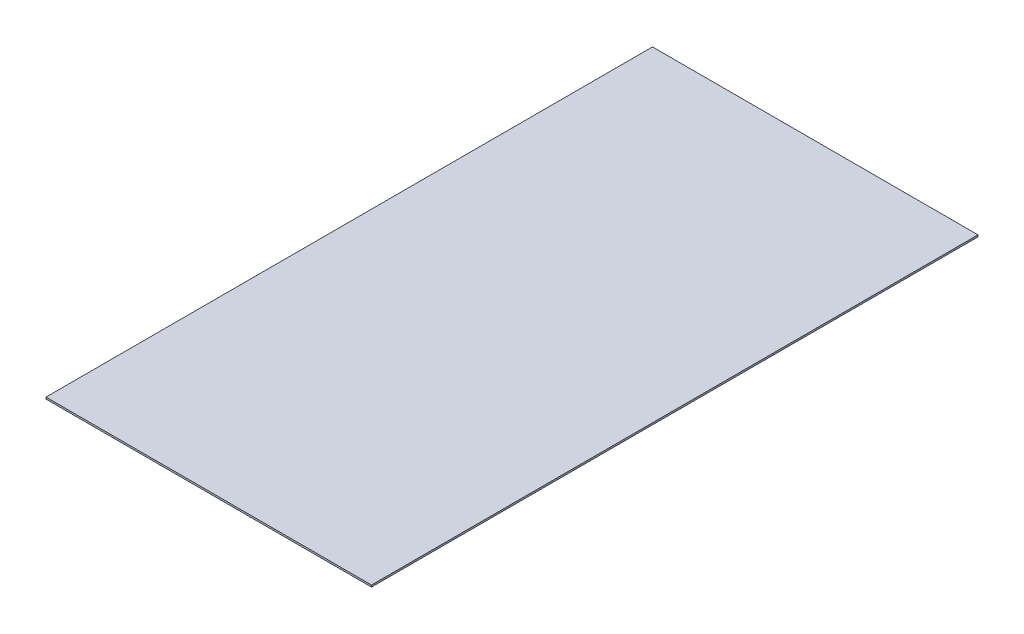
ISO-10303-21;
HEADER;
FILE_DESCRIPTION(('STEP AP214'),'2;1');
FILE_NAME('part.step','',(''),(''),'','','');
FILE_SCHEMA(('AUTOMOTIVE_DESIGN { 1 0 10303 214 1 1 1 1 }'));
ENDSEC;
DATA;
#1=APPLICATION_CONTEXT('core data for automotive mechanical design processes');
#2=APPLICATION_PROTOCOL_DEFINITION('international standard','automotive_design',2000,#1);
#3=PRODUCT_CONTEXT('',#1,'mechanical');
#4=PRODUCT('Part','Part','',(#3));
#5=PRODUCT_RELATED_PRODUCT_CATEGORY('part','',(#4));
#6=PRODUCT_DEFINITION_FORMATION('','',#4);
#7=PRODUCT_DEFINITION_CONTEXT('part definition',#1,'design');
#8=PRODUCT_DEFINITION('design','',#6,#7);
#9=PRODUCT_DEFINITION_SHAPE('','',#8);
#10=(LENGTH_UNIT() NAMED_UNIT(*) SI_UNIT(.MILLI.,.METRE.));
#11=(NAMED_UNIT(*) PLANE_ANGLE_UNIT() SI_UNIT($,.RADIAN.));
#12=(NAMED_UNIT(*) SI_UNIT($,.STERADIAN.) SOLID_ANGLE_UNIT());
#13=UNCERTAINTY_MEASURE_WITH_UNIT(LENGTH_MEASURE(1.E-05),#10,'distance_accuracy_value','');
#14=(GEOMETRIC_REPRESENTATION_CONTEXT(3) GLOBAL_UNCERTAINTY_ASSIGNED_CONTEXT((#13)) GLOBAL_UNIT_ASSIGNED_CONTEXT((#10,
#11,#12)) REPRESENTATION_CONTEXT('',''));
#15=CARTESIAN_POINT('',(0.,0.,0.));
#16=DIRECTION('',(0.,0.,1.));
#17=DIRECTION('',(1.,0.,0.));
#18=AXIS2_PLACEMENT_3D('',#15,#16,#17);
#19=CARTESIAN_POINT('',(429.41875,4.7625,-800.1));
#20=DIRECTION('',(-1.,0.,0.));
#21=DIRECTION('',(0.,0.,1.));
#22=AXIS2_PLACEMENT_3D('',#19,#20,#21);
#23=PLANE('',#22);
#24=DIRECTION('',(0.,0.,-1.));
#25=VECTOR('',#24,1.);
#26=CARTESIAN_POINT('',(429.41875,0.,-800.1));
#27=LINE('',#26,#25);
#28=CARTESIAN_POINT('',(429.41875,0.,800.1));
#29=VERTEX_POINT('',#28);
#30=CARTESIAN_POINT('',(429.41875,0.,-800.1));
#31=VERTEX_POINT('',#30);
#32=EDGE_CURVE('E100',#29,#31,#27,.T.);
#33=ORIENTED_EDGE('',*,*,#32,.T.);
#34=DIRECTION('',(0.,-1.,0.));
#35=VECTOR('',#34,1.);
#36=CARTESIAN_POINT('',(429.41875,4.7625,-800.1));
#37=LINE('',#36,#35);
#38=CARTESIAN_POINT('',(429.41875,4.7625,-800.1));
#39=VERTEX_POINT('',#38);
#40=EDGE_CURVE('E11',#39,#31,#37,.T.);
#41=ORIENTED_EDGE('',*,*,#40,.F.);
#42=DIRECTION('',(0.,0.,-1.));
#43=VECTOR('',#42,1.);
#44=CARTESIAN_POINT('',(429.41875,4.7625,-800.1));
#45=LINE('',#44,#43);
#46=CARTESIAN_POINT('',(429.41875,4.7625,800.1));
#47=VERTEX_POINT('',#46);
#48=EDGE_CURVE('E88',#47,#39,#45,.T.);
#49=ORIENTED_EDGE('',*,*,#48,.F.);
#50=DIRECTION('',(0.,-1.,0.));
#51=VECTOR('',#50,1.);
#52=CARTESIAN_POINT('',(429.41875,4.7625,800.1));
#53=LINE('',#52,#51);
#54=EDGE_CURVE('E96',#47,#29,#53,.T.);
#55=ORIENTED_EDGE('',*,*,#54,.T.);
#56=EDGE_LOOP('',(#33,#41,#49,#55));
#57=FACE_BOUND('',#56,.T.);
#58=ADVANCED_FACE('F37',(#57),#23,.F.);
#59=CARTESIAN_POINT('',(-429.41875,4.7625,-800.1));
#60=DIRECTION('',(0.,0.,1.));
#61=DIRECTION('',(1.,0.,0.));
#62=AXIS2_PLACEMENT_3D('',#59,#60,#61);
#63=PLANE('',#62);
#64=DIRECTION('',(-1.,0.,0.));
#65=VECTOR('',#64,1.);
#66=CARTESIAN_POINT('',(-429.41875,0.,-800.1));
#67=LINE('',#66,#65);
#68=CARTESIAN_POINT('',(-429.41875,0.,-800.1));
#69=VERTEX_POINT('',#68);
#70=EDGE_CURVE('E92',#31,#69,#67,.T.);
#71=ORIENTED_EDGE('',*,*,#70,.T.);
#72=DIRECTION('',(0.,-1.,0.));
#73=VECTOR('',#72,1.);
#74=CARTESIAN_POINT('',(-429.41875,4.7625,-800.1));
#75=LINE('',#74,#73);
#76=CARTESIAN_POINT('',(-429.41875,4.7625,-800.1));
#77=VERTEX_POINT('',#76);
#78=EDGE_CURVE('E45',#77,#69,#75,.T.);
#79=ORIENTED_EDGE('',*,*,#78,.F.);
#80=DIRECTION('',(-1.,0.,0.));
#81=VECTOR('',#80,1.);
#82=CARTESIAN_POINT('',(-429.41875,4.7625,-800.1));
#83=LINE('',#82,#81);
#84=EDGE_CURVE('E83',#39,#77,#83,.T.);
#85=ORIENTED_EDGE('',*,*,#84,.F.);
#86=ORIENTED_EDGE('',*,*,#40,.T.);
#87=EDGE_LOOP('',(#71,#79,#85,#86));
#88=FACE_BOUND('',#87,.T.);
#89=ADVANCED_FACE('F91',(#88),#63,.F.);
#90=CARTESIAN_POINT('',(-429.41875,4.7625,-800.1));
#91=DIRECTION('',(1.,0.,0.));
#92=DIRECTION('',(0.,0.,-1.));
#93=AXIS2_PLACEMENT_3D('',#90,#91,#92);
#94=PLANE('',#93);
#95=DIRECTION('',(0.,0.,1.));
#96=VECTOR('',#95,1.);
#97=CARTESIAN_POINT('',(-429.41875,0.,-800.1));
#98=LINE('',#97,#96);
#99=CARTESIAN_POINT('',(-429.41875,0.,800.1));
#100=VERTEX_POINT('',#99);
#101=EDGE_CURVE('E70',#69,#100,#98,.T.);
#102=ORIENTED_EDGE('',*,*,#101,.T.);
#103=DIRECTION('',(0.,-1.,0.));
#104=VECTOR('',#103,1.);
#105=CARTESIAN_POINT('',(-429.41875,4.7625,800.1));
#106=LINE('',#105,#104);
#107=CARTESIAN_POINT('',(-429.41875,4.7625,800.1));
#108=VERTEX_POINT('',#107);
#109=EDGE_CURVE('E93',#108,#100,#106,.T.);
#110=ORIENTED_EDGE('',*,*,#109,.F.);
#111=DIRECTION('',(0.,0.,1.));
#112=VECTOR('',#111,1.);
#113=CARTESIAN_POINT('',(-429.41875,4.7625,-800.1));
#114=LINE('',#113,#112);
#115=EDGE_CURVE('E86',#77,#108,#114,.T.);
#116=ORIENTED_EDGE('',*,*,#115,.F.);
#117=ORIENTED_EDGE('',*,*,#78,.T.);
#118=EDGE_LOOP('',(#102,#110,#116,#117));
#119=FACE_BOUND('',#118,.T.);
#120=ADVANCED_FACE('F94',(#119),#94,.F.);
#121=CARTESIAN_POINT('',(-429.41875,4.7625,800.1));
#122=DIRECTION('',(0.,0.,-1.));
#123=DIRECTION('',(-1.,0.,0.));
#124=AXIS2_PLACEMENT_3D('',#121,#122,#123);
#125=PLANE('',#124);
#126=DIRECTION('',(1.,0.,0.));
#127=VECTOR('',#126,1.);
#128=CARTESIAN_POINT('',(-429.41875,0.,800.1));
#129=LINE('',#128,#127);
#130=EDGE_CURVE('E76',#100,#29,#129,.T.);
#131=ORIENTED_EDGE('',*,*,#130,.T.);
#132=ORIENTED_EDGE('',*,*,#54,.F.);
#133=DIRECTION('',(1.,0.,0.));
#134=VECTOR('',#133,1.);
#135=CARTESIAN_POINT('',(-429.41875,4.7625,800.1));
#136=LINE('',#135,#134);
#137=EDGE_CURVE('E53',#108,#47,#136,.T.);
#138=ORIENTED_EDGE('',*,*,#137,.F.);
#139=ORIENTED_EDGE('',*,*,#109,.T.);
#140=EDGE_LOOP('',(#131,#132,#138,#139));
#141=FACE_BOUND('',#140,.T.);
#142=ADVANCED_FACE('F107',(#141),#125,.F.);
#143=CARTESIAN_POINT('',(429.41875,4.7625,800.1));
#144=DIRECTION('',(0.,1.,0.));
#145=DIRECTION('',(0.,0.,1.));
#146=AXIS2_PLACEMENT_3D('',#143,#144,#145);
#147=PLANE('',#146);
#148=ORIENTED_EDGE('',*,*,#48,.T.);
#149=ORIENTED_EDGE('',*,*,#84,.T.);
#150=ORIENTED_EDGE('',*,*,#115,.T.);
#151=ORIENTED_EDGE('',*,*,#137,.T.);
#152=EDGE_LOOP('',(#148,#149,#150,#151));
#153=FACE_BOUND('',#152,.T.);
#154=ADVANCED_FACE('F84',(#153),#147,.T.);
#155=CARTESIAN_POINT('',(429.41875,0.,800.1));
#156=DIRECTION('',(0.,1.,0.));
#157=DIRECTION('',(0.,0.,1.));
#158=AXIS2_PLACEMENT_3D('',#155,#156,#157);
#159=PLANE('',#158);
#160=ORIENTED_EDGE('',*,*,#32,.F.);
#161=ORIENTED_EDGE('',*,*,#130,.F.);
#162=ORIENTED_EDGE('',*,*,#101,.F.);
#163=ORIENTED_EDGE('',*,*,#70,.F.);
#164=EDGE_LOOP('',(#160,#161,#162,#163));
#165=FACE_BOUND('',#164,.T.);
#166=ADVANCED_FACE('F110',(#165),#159,.F.);
#167=CLOSED_SHELL('',(#58,#89,#120,#142,#154,#166));
#168=MANIFOLD_SOLID_BREP('B2',#167);
#169=ADVANCED_BREP_SHAPE_REPRESENTATION('',(#18,#168),#14);
#170=SHAPE_DEFINITION_REPRESENTATION(#9,#169);
ENDSEC;
END-ISO-10303-21;
